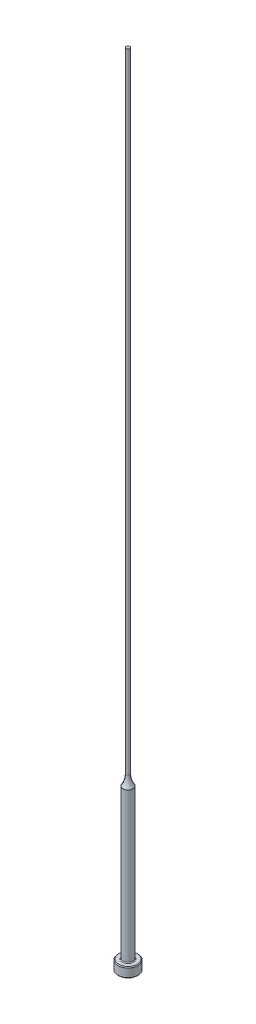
ISO-10303-21;
HEADER;
FILE_DESCRIPTION(('STEP AP214'),'2;1');
FILE_NAME('part.step','',(''),(''),'','','');
FILE_SCHEMA(('AUTOMOTIVE_DESIGN { 1 0 10303 214 1 1 1 1 }'));
ENDSEC;
DATA;
#1=APPLICATION_CONTEXT('core data for automotive mechanical design processes');
#2=APPLICATION_PROTOCOL_DEFINITION('international standard','automotive_design',2000,#1);
#3=PRODUCT_CONTEXT('',#1,'mechanical');
#4=PRODUCT('Part','Part','',(#3));
#5=PRODUCT_RELATED_PRODUCT_CATEGORY('part','',(#4));
#6=PRODUCT_DEFINITION_FORMATION('','',#4);
#7=PRODUCT_DEFINITION_CONTEXT('part definition',#1,'design');
#8=PRODUCT_DEFINITION('design','',#6,#7);
#9=PRODUCT_DEFINITION_SHAPE('','',#8);
#10=(LENGTH_UNIT() NAMED_UNIT(*) SI_UNIT(.MILLI.,.METRE.));
#11=(NAMED_UNIT(*) PLANE_ANGLE_UNIT() SI_UNIT($,.RADIAN.));
#12=(NAMED_UNIT(*) SI_UNIT($,.STERADIAN.) SOLID_ANGLE_UNIT());
#13=UNCERTAINTY_MEASURE_WITH_UNIT(LENGTH_MEASURE(1.E-05),#10,'distance_accuracy_value','');
#14=(GEOMETRIC_REPRESENTATION_CONTEXT(3) GLOBAL_UNCERTAINTY_ASSIGNED_CONTEXT((#13)) GLOBAL_UNIT_ASSIGNED_CONTEXT((#10,
#11,#12)) REPRESENTATION_CONTEXT('',''));
#15=CARTESIAN_POINT('',(0.,0.,0.));
#16=DIRECTION('',(0.,0.,1.));
#17=DIRECTION('',(1.,0.,0.));
#18=AXIS2_PLACEMENT_3D('',#15,#16,#17);
#19=CARTESIAN_POINT('',(-0.594359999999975,254.,0.));
#20=DIRECTION('',(0.,1.,0.));
#21=DIRECTION('',(0.,0.,1.));
#22=AXIS2_PLACEMENT_3D('',#19,#20,#21);
#23=PLANE('',#22);
#24=CARTESIAN_POINT('',(0.,254.,0.));
#25=DIRECTION('',(0.,1.,0.));
#26=DIRECTION('',(0.,0.,1.));
#27=AXIS2_PLACEMENT_3D('',#24,#25,#26);
#28=CIRCLE('',#27,0.594359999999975);
#29=CARTESIAN_POINT('',(0.,254.,0.594359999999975));
#30=VERTEX_POINT('',#29);
#31=EDGE_CURVE('E61',#30,#30,#28,.T.);
#32=ORIENTED_EDGE('',*,*,#31,.T.);
#33=EDGE_LOOP('',(#32));
#34=FACE_BOUND('',#33,.T.);
#35=ADVANCED_FACE('F35',(#34),#23,.T.);
#36=CARTESIAN_POINT('',(0.,259.958771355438,0.));
#37=DIRECTION('',(0.,1.,0.));
#38=DIRECTION('',(0.,0.,1.));
#39=AXIS2_PLACEMENT_3D('',#36,#37,#38);
#40=CYLINDRICAL_SURFACE('',#39,0.594359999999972);
#41=CARTESIAN_POINT('',(0.,54.2097728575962,0.));
#42=DIRECTION('',(0.,1.,0.));
#43=DIRECTION('',(0.,0.,1.));
#44=AXIS2_PLACEMENT_3D('',#41,#42,#43);
#45=CIRCLE('',#44,0.59435999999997);
#46=CARTESIAN_POINT('',(0.,54.2097728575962,0.59435999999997));
#47=VERTEX_POINT('',#46);
#48=EDGE_CURVE('E64',#47,#47,#45,.T.);
#49=ORIENTED_EDGE('',*,*,#48,.T.);
#50=EDGE_LOOP('',(#49));
#51=FACE_BOUND('',#50,.T.);
#52=ORIENTED_EDGE('',*,*,#31,.F.);
#53=EDGE_LOOP('',(#52));
#54=FACE_BOUND('',#53,.T.);
#55=ADVANCED_FACE('F84',(#51,#54),#40,.T.);
#56=CARTESIAN_POINT('',(0.,54.2097728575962,0.));
#57=DIRECTION('',(0.,1.,0.));
#58=DIRECTION('',(0.,0.,1.));
#59=AXIS2_PLACEMENT_3D('',#56,#57,#58);
#60=TOROIDAL_SURFACE('',#59,6.94435999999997,6.35);
#61=CARTESIAN_POINT('',(0.,50.8,0.));
#62=DIRECTION('',(0.,1.,0.));
#63=DIRECTION('',(0.,0.,1.));
#64=AXIS2_PLACEMENT_3D('',#61,#62,#63);
#65=CIRCLE('',#64,1.58749999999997);
#66=CARTESIAN_POINT('',(0.,50.8,1.58749999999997));
#67=VERTEX_POINT('',#66);
#68=EDGE_CURVE('E67',#67,#67,#65,.T.);
#69=ORIENTED_EDGE('',*,*,#68,.T.);
#70=EDGE_LOOP('',(#69));
#71=FACE_BOUND('',#70,.T.);
#72=ORIENTED_EDGE('',*,*,#48,.F.);
#73=EDGE_LOOP('',(#72));
#74=FACE_BOUND('',#73,.T.);
#75=ADVANCED_FACE('F71',(#71,#74),#60,.F.);
#76=CARTESIAN_POINT('',(0.,259.958771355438,0.));
#77=DIRECTION('',(0.,1.,0.));
#78=DIRECTION('',(0.,0.,1.));
#79=AXIS2_PLACEMENT_3D('',#76,#77,#78);
#80=CYLINDRICAL_SURFACE('',#79,1.58749999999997);
#81=CARTESIAN_POINT('',(0.,3.42900000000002,0.));
#82=DIRECTION('',(0.,1.,0.));
#83=DIRECTION('',(0.,0.,1.));
#84=AXIS2_PLACEMENT_3D('',#81,#82,#83);
#85=CIRCLE('',#84,1.58749999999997);
#86=CARTESIAN_POINT('',(0.,3.42900000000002,1.58749999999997));
#87=VERTEX_POINT('',#86);
#88=EDGE_CURVE('E42',#87,#87,#85,.T.);
#89=ORIENTED_EDGE('',*,*,#88,.T.);
#90=EDGE_LOOP('',(#89));
#91=FACE_BOUND('',#90,.T.);
#92=ORIENTED_EDGE('',*,*,#68,.F.);
#93=EDGE_LOOP('',(#92));
#94=FACE_BOUND('',#93,.T.);
#95=ADVANCED_FACE('F74',(#91,#94),#80,.T.);
#96=CARTESIAN_POINT('',(-3.17499999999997,3.175,0.));
#97=DIRECTION('',(0.,1.,0.));
#98=DIRECTION('',(0.,0.,1.));
#99=AXIS2_PLACEMENT_3D('',#96,#97,#98);
#100=PLANE('',#99);
#101=CARTESIAN_POINT('',(0.,3.175,0.));
#102=DIRECTION('',(0.,1.,0.));
#103=DIRECTION('',(0.,0.,1.));
#104=AXIS2_PLACEMENT_3D('',#101,#102,#103);
#105=CIRCLE('',#104,1.84149999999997);
#106=CARTESIAN_POINT('',(0.,3.175,1.84149999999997));
#107=VERTEX_POINT('',#106);
#108=EDGE_CURVE('E10',#107,#107,#105,.F.);
#109=ORIENTED_EDGE('',*,*,#108,.T.);
#110=EDGE_LOOP('',(#109));
#111=FACE_BOUND('',#110,.T.);
#112=CARTESIAN_POINT('',(0.,3.175,0.));
#113=DIRECTION('',(0.,1.,0.));
#114=DIRECTION('',(0.,0.,1.));
#115=AXIS2_PLACEMENT_3D('',#112,#113,#114);
#116=CIRCLE('',#115,2.92099999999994);
#117=CARTESIAN_POINT('',(0.,3.175,2.92099999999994));
#118=VERTEX_POINT('',#117);
#119=EDGE_CURVE('E58',#118,#118,#116,.T.);
#120=ORIENTED_EDGE('',*,*,#119,.T.);
#121=EDGE_LOOP('',(#120));
#122=FACE_BOUND('',#121,.T.);
#123=ADVANCED_FACE('F76',(#111,#122),#100,.T.);
#124=CARTESIAN_POINT('',(0.,259.958771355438,0.));
#125=DIRECTION('',(0.,1.,0.));
#126=DIRECTION('',(0.,0.,1.));
#127=AXIS2_PLACEMENT_3D('',#124,#125,#126);
#128=CYLINDRICAL_SURFACE('',#127,3.17499999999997);
#129=CARTESIAN_POINT('',(0.,2.92100000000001,0.));
#130=DIRECTION('',(0.,1.,0.));
#131=DIRECTION('',(0.,0.,1.));
#132=AXIS2_PLACEMENT_3D('',#129,#130,#131);
#133=CIRCLE('',#132,3.17499999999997);
#134=CARTESIAN_POINT('',(0.,2.92100000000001,3.17499999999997));
#135=VERTEX_POINT('',#134);
#136=EDGE_CURVE('E50',#135,#135,#133,.F.);
#137=ORIENTED_EDGE('',*,*,#136,.T.);
#138=EDGE_LOOP('',(#137));
#139=FACE_BOUND('',#138,.T.);
#140=CARTESIAN_POINT('',(0.,0.253999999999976,0.));
#141=DIRECTION('',(0.,-1.,0.));
#142=DIRECTION('',(0.,0.,-1.));
#143=AXIS2_PLACEMENT_3D('',#140,#141,#142);
#144=CIRCLE('',#143,3.17499999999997);
#145=CARTESIAN_POINT('',(0.,0.253999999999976,-3.17499999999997));
#146=VERTEX_POINT('',#145);
#147=EDGE_CURVE('E55',#146,#146,#144,.F.);
#148=ORIENTED_EDGE('',*,*,#147,.T.);
#149=EDGE_LOOP('',(#148));
#150=FACE_BOUND('',#149,.T.);
#151=ADVANCED_FACE('F82',(#139,#150),#128,.T.);
#152=CARTESIAN_POINT('',(0.,0.,0.));
#153=DIRECTION('',(0.,-1.,0.));
#154=DIRECTION('',(0.,0.,-1.));
#155=AXIS2_PLACEMENT_3D('',#152,#153,#154);
#156=PLANE('',#155);
#157=CARTESIAN_POINT('',(0.,0.,0.));
#158=DIRECTION('',(0.,-1.,0.));
#159=DIRECTION('',(0.,0.,-1.));
#160=AXIS2_PLACEMENT_3D('',#157,#158,#159);
#161=CIRCLE('',#160,2.92100000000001);
#162=CARTESIAN_POINT('',(0.,0.,-2.92100000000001));
#163=VERTEX_POINT('',#162);
#164=EDGE_CURVE('E46',#163,#163,#161,.T.);
#165=ORIENTED_EDGE('',*,*,#164,.T.);
#166=EDGE_LOOP('',(#165));
#167=FACE_BOUND('',#166,.T.);
#168=ADVANCED_FACE('F98',(#167),#156,.T.);
#169=CARTESIAN_POINT('',(0.,3.17499999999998,0.));
#170=DIRECTION('',(0.,-1.,0.));
#171=DIRECTION('',(0.,0.,-1.));
#172=AXIS2_PLACEMENT_3D('',#169,#170,#171);
#173=CONICAL_SURFACE('',#172,2.92099999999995,0.785398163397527);
#174=ORIENTED_EDGE('',*,*,#136,.F.);
#175=EDGE_LOOP('',(#174));
#176=FACE_BOUND('',#175,.T.);
#177=ORIENTED_EDGE('',*,*,#119,.F.);
#178=EDGE_LOOP('',(#177));
#179=FACE_BOUND('',#178,.T.);
#180=ADVANCED_FACE('F95',(#176,#179),#173,.T.);
#181=CARTESIAN_POINT('',(0.,0.253999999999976,0.));
#182=DIRECTION('',(0.,1.,0.));
#183=DIRECTION('',(0.,0.,1.));
#184=AXIS2_PLACEMENT_3D('',#181,#182,#183);
#185=CONICAL_SURFACE('',#184,3.17499999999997,0.785398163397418);
#186=ORIENTED_EDGE('',*,*,#164,.F.);
#187=EDGE_LOOP('',(#186));
#188=FACE_BOUND('',#187,.T.);
#189=ORIENTED_EDGE('',*,*,#147,.F.);
#190=EDGE_LOOP('',(#189));
#191=FACE_BOUND('',#190,.T.);
#192=ADVANCED_FACE('F97',(#188,#191),#185,.T.);
#193=CARTESIAN_POINT('',(0.,3.42900000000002,0.));
#194=DIRECTION('',(0.,1.,0.));
#195=DIRECTION('',(0.,0.,1.));
#196=AXIS2_PLACEMENT_3D('',#193,#194,#195);
#197=TOROIDAL_SURFACE('',#196,1.84149999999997,0.254);
#198=ORIENTED_EDGE('',*,*,#108,.F.);
#199=EDGE_LOOP('',(#198));
#200=FACE_BOUND('',#199,.T.);
#201=ORIENTED_EDGE('',*,*,#88,.F.);
#202=EDGE_LOOP('',(#201));
#203=FACE_BOUND('',#202,.T.);
#204=ADVANCED_FACE('F37',(#200,#203),#197,.F.);
#205=CLOSED_SHELL('',(#35,#55,#75,#95,#123,#151,#168,#180,#192,#204));
#206=MANIFOLD_SOLID_BREP('B2',#205);
#207=ADVANCED_BREP_SHAPE_REPRESENTATION('',(#18,#206),#14);
#208=SHAPE_DEFINITION_REPRESENTATION(#9,#207);
ENDSEC;
END-ISO-10303-21;
